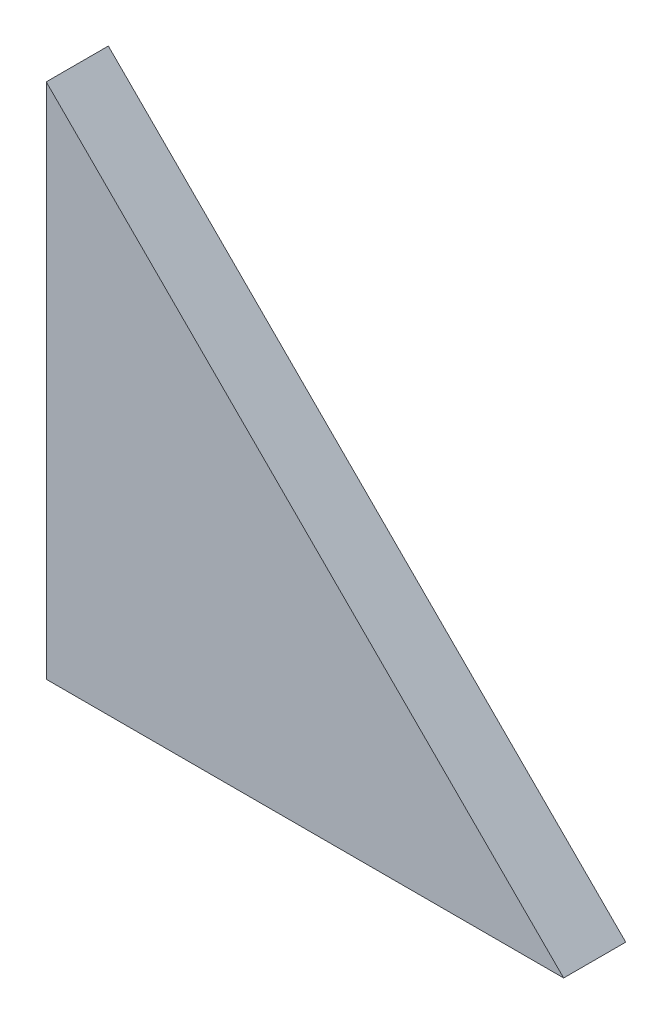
from build123d import *

# Parameters (mm, degrees)
EXTRUDE1_DEPTH      = 3
EXTRUDE1_DEPTH_BACK = 3


with BuildPart() as part:
    # Sketch1 → Extrude1 (new, two sides: drawn at the far end of the back side and taken through both)
    with BuildSketch(Plane.XY.offset(-EXTRUDE1_DEPTH_BACK)):
        Polygon((0, 0), (0, 50), (50, 0), align=None)
    extrude(amount=EXTRUDE1_DEPTH + EXTRUDE1_DEPTH_BACK)


solid = part.part
